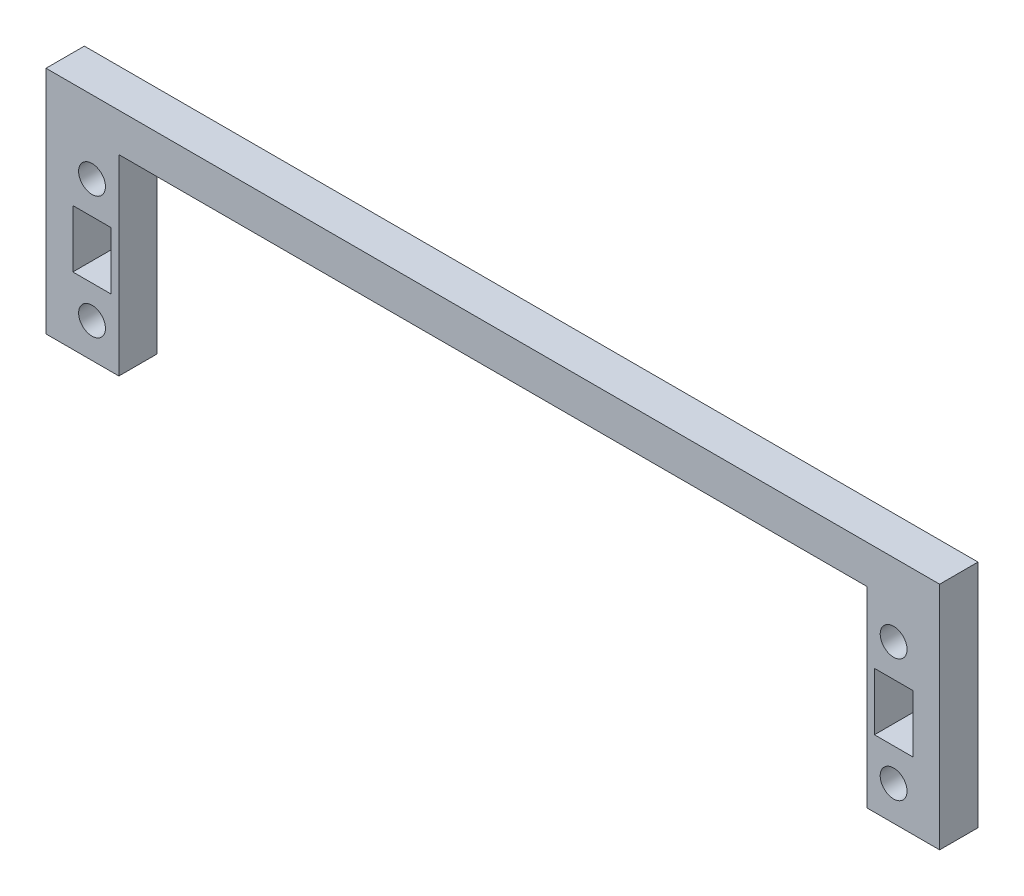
ISO-10303-21;
HEADER;
FILE_DESCRIPTION(('STEP AP214'),'2;1');
FILE_NAME('part.step','',(''),(''),'','','');
FILE_SCHEMA(('AUTOMOTIVE_DESIGN { 1 0 10303 214 1 1 1 1 }'));
ENDSEC;
DATA;
#1=APPLICATION_CONTEXT('core data for automotive mechanical design processes');
#2=APPLICATION_PROTOCOL_DEFINITION('international standard','automotive_design',2000,#1);
#3=PRODUCT_CONTEXT('',#1,'mechanical');
#4=PRODUCT('Part','Part','',(#3));
#5=PRODUCT_RELATED_PRODUCT_CATEGORY('part','',(#4));
#6=PRODUCT_DEFINITION_FORMATION('','',#4);
#7=PRODUCT_DEFINITION_CONTEXT('part definition',#1,'design');
#8=PRODUCT_DEFINITION('design','',#6,#7);
#9=PRODUCT_DEFINITION_SHAPE('','',#8);
#10=(LENGTH_UNIT() NAMED_UNIT(*) SI_UNIT(.MILLI.,.METRE.));
#11=(NAMED_UNIT(*) PLANE_ANGLE_UNIT() SI_UNIT($,.RADIAN.));
#12=(NAMED_UNIT(*) SI_UNIT($,.STERADIAN.) SOLID_ANGLE_UNIT());
#13=UNCERTAINTY_MEASURE_WITH_UNIT(LENGTH_MEASURE(1.E-05),#10,'distance_accuracy_value','');
#14=(GEOMETRIC_REPRESENTATION_CONTEXT(3) GLOBAL_UNCERTAINTY_ASSIGNED_CONTEXT((#13)) GLOBAL_UNIT_ASSIGNED_CONTEXT((#10,
#11,#12)) REPRESENTATION_CONTEXT('',''));
#15=CARTESIAN_POINT('',(0.,0.,0.));
#16=DIRECTION('',(0.,0.,1.));
#17=DIRECTION('',(1.,0.,0.));
#18=AXIS2_PLACEMENT_3D('',#15,#16,#17);
#19=CARTESIAN_POINT('',(0.,-25.,10.));
#20=DIRECTION('',(0.,-1.,0.));
#21=DIRECTION('',(0.,0.,-1.));
#22=AXIS2_PLACEMENT_3D('',#19,#20,#21);
#23=PLANE('',#22);
#24=DIRECTION('',(-1.,0.,0.));
#25=VECTOR('',#24,1.);
#26=CARTESIAN_POINT('',(0.,-25.,0.));
#27=LINE('',#26,#25);
#28=CARTESIAN_POINT('',(-97.5,-25.,0.));
#29=VERTEX_POINT('',#28);
#30=CARTESIAN_POINT('',(-116.5,-25.,0.));
#31=VERTEX_POINT('',#30);
#32=EDGE_CURVE('E102',#29,#31,#27,.T.);
#33=ORIENTED_EDGE('',*,*,#32,.F.);
#34=DIRECTION('',(0.,0.,-1.));
#35=VECTOR('',#34,1.);
#36=CARTESIAN_POINT('',(-97.5,-25.,10.));
#37=LINE('',#36,#35);
#38=CARTESIAN_POINT('',(-97.5,-25.,10.));
#39=VERTEX_POINT('',#38);
#40=EDGE_CURVE('E11',#39,#29,#37,.T.);
#41=ORIENTED_EDGE('',*,*,#40,.F.);
#42=DIRECTION('',(-1.,0.,0.));
#43=VECTOR('',#42,1.);
#44=CARTESIAN_POINT('',(0.,-25.,10.));
#45=LINE('',#44,#43);
#46=CARTESIAN_POINT('',(-116.5,-25.,10.));
#47=VERTEX_POINT('',#46);
#48=EDGE_CURVE('E100',#39,#47,#45,.T.);
#49=ORIENTED_EDGE('',*,*,#48,.T.);
#50=DIRECTION('',(0.,0.,-1.));
#51=VECTOR('',#50,1.);
#52=CARTESIAN_POINT('',(-116.5,-25.,10.));
#53=LINE('',#52,#51);
#54=EDGE_CURVE('E52',#47,#31,#53,.T.);
#55=ORIENTED_EDGE('',*,*,#54,.T.);
#56=EDGE_LOOP('',(#33,#41,#49,#55));
#57=FACE_BOUND('',#56,.T.);
#58=ADVANCED_FACE('F33',(#57),#23,.T.);
#59=CARTESIAN_POINT('',(-97.5,0.,10.));
#60=DIRECTION('',(-1.,0.,0.));
#61=DIRECTION('',(0.,0.,1.));
#62=AXIS2_PLACEMENT_3D('',#59,#60,#61);
#63=PLANE('',#62);
#64=DIRECTION('',(0.,1.,0.));
#65=VECTOR('',#64,1.);
#66=CARTESIAN_POINT('',(-97.5,0.,0.));
#67=LINE('',#66,#65);
#68=CARTESIAN_POINT('',(-97.5,25.,0.));
#69=VERTEX_POINT('',#68);
#70=EDGE_CURVE('E144',#29,#69,#67,.T.);
#71=ORIENTED_EDGE('',*,*,#70,.T.);
#72=DIRECTION('',(0.,0.,-1.));
#73=VECTOR('',#72,1.);
#74=CARTESIAN_POINT('',(-97.5,25.,10.));
#75=LINE('',#74,#73);
#76=CARTESIAN_POINT('',(-97.5,25.,10.));
#77=VERTEX_POINT('',#76);
#78=EDGE_CURVE('E43',#77,#69,#75,.T.);
#79=ORIENTED_EDGE('',*,*,#78,.F.);
#80=DIRECTION('',(0.,1.,0.));
#81=VECTOR('',#80,1.);
#82=CARTESIAN_POINT('',(-97.5,0.,10.));
#83=LINE('',#82,#81);
#84=EDGE_CURVE('E104',#39,#77,#83,.T.);
#85=ORIENTED_EDGE('',*,*,#84,.F.);
#86=ORIENTED_EDGE('',*,*,#40,.T.);
#87=EDGE_LOOP('',(#71,#79,#85,#86));
#88=FACE_BOUND('',#87,.T.);
#89=ADVANCED_FACE('F105',(#88),#63,.F.);
#90=CARTESIAN_POINT('',(0.,7.49999999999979,10.));
#91=DIRECTION('',(0.,1.,0.));
#92=DIRECTION('',(-1.,0.,0.));
#93=AXIS2_PLACEMENT_3D('',#90,#91,#92);
#94=PLANE('',#93);
#95=DIRECTION('',(1.,0.,0.));
#96=VECTOR('',#95,1.);
#97=CARTESIAN_POINT('',(0.,7.49999999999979,0.));
#98=LINE('',#97,#96);
#99=CARTESIAN_POINT('',(-109.5,7.5,0.));
#100=VERTEX_POINT('',#99);
#101=CARTESIAN_POINT('',(-99.5,7.49999999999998,0.));
#102=VERTEX_POINT('',#101);
#103=EDGE_CURVE('E130',#100,#102,#98,.T.);
#104=ORIENTED_EDGE('',*,*,#103,.T.);
#105=DIRECTION('',(0.,0.,-1.));
#106=VECTOR('',#105,1.);
#107=CARTESIAN_POINT('',(-99.5,7.49999999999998,10.));
#108=LINE('',#107,#106);
#109=CARTESIAN_POINT('',(-99.5,7.49999999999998,10.));
#110=VERTEX_POINT('',#109);
#111=EDGE_CURVE('E37',#110,#102,#108,.T.);
#112=ORIENTED_EDGE('',*,*,#111,.F.);
#113=DIRECTION('',(1.,0.,0.));
#114=VECTOR('',#113,1.);
#115=CARTESIAN_POINT('',(0.,7.49999999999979,10.));
#116=LINE('',#115,#114);
#117=CARTESIAN_POINT('',(-109.5,7.5,10.));
#118=VERTEX_POINT('',#117);
#119=EDGE_CURVE('E155',#118,#110,#116,.T.);
#120=ORIENTED_EDGE('',*,*,#119,.F.);
#121=DIRECTION('',(0.,0.,-1.));
#122=VECTOR('',#121,1.);
#123=CARTESIAN_POINT('',(-109.5,7.5,10.));
#124=LINE('',#123,#122);
#125=EDGE_CURVE('E129',#118,#100,#124,.T.);
#126=ORIENTED_EDGE('',*,*,#125,.T.);
#127=EDGE_LOOP('',(#104,#112,#120,#126));
#128=FACE_BOUND('',#127,.T.);
#129=ADVANCED_FACE('F35',(#128),#94,.F.);
#130=CARTESIAN_POINT('',(-99.5,0.,10.));
#131=DIRECTION('',(1.,0.,0.));
#132=DIRECTION('',(0.,0.,-1.));
#133=AXIS2_PLACEMENT_3D('',#130,#131,#132);
#134=PLANE('',#133);
#135=DIRECTION('',(0.,-1.,0.));
#136=VECTOR('',#135,1.);
#137=CARTESIAN_POINT('',(-99.5,0.,0.));
#138=LINE('',#137,#136);
#139=CARTESIAN_POINT('',(-99.5,-7.50000000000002,0.));
#140=VERTEX_POINT('',#139);
#141=EDGE_CURVE('E133',#102,#140,#138,.T.);
#142=ORIENTED_EDGE('',*,*,#141,.T.);
#143=DIRECTION('',(0.,0.,-1.));
#144=VECTOR('',#143,1.);
#145=CARTESIAN_POINT('',(-99.5,-7.50000000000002,10.));
#146=LINE('',#145,#144);
#147=CARTESIAN_POINT('',(-99.5,-7.50000000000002,10.));
#148=VERTEX_POINT('',#147);
#149=EDGE_CURVE('E160',#148,#140,#146,.T.);
#150=ORIENTED_EDGE('',*,*,#149,.F.);
#151=DIRECTION('',(0.,-1.,0.));
#152=VECTOR('',#151,1.);
#153=CARTESIAN_POINT('',(-99.5,0.,10.));
#154=LINE('',#153,#152);
#155=EDGE_CURVE('E88',#110,#148,#154,.T.);
#156=ORIENTED_EDGE('',*,*,#155,.F.);
#157=ORIENTED_EDGE('',*,*,#111,.T.);
#158=EDGE_LOOP('',(#142,#150,#156,#157));
#159=FACE_BOUND('',#158,.T.);
#160=ADVANCED_FACE('F165',(#159),#134,.F.);
#161=CARTESIAN_POINT('',(0.,-7.50000000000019,10.));
#162=DIRECTION('',(0.,1.,0.));
#163=DIRECTION('',(-1.,0.,0.));
#164=AXIS2_PLACEMENT_3D('',#161,#162,#163);
#165=PLANE('',#164);
#166=DIRECTION('',(1.,0.,0.));
#167=VECTOR('',#166,1.);
#168=CARTESIAN_POINT('',(0.,-7.50000000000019,0.));
#169=LINE('',#168,#167);
#170=CARTESIAN_POINT('',(-109.5,-7.5,0.));
#171=VERTEX_POINT('',#170);
#172=EDGE_CURVE('E137',#171,#140,#169,.T.);
#173=ORIENTED_EDGE('',*,*,#172,.F.);
#174=DIRECTION('',(0.,0.,-1.));
#175=VECTOR('',#174,1.);
#176=CARTESIAN_POINT('',(-109.5,-7.5,10.));
#177=LINE('',#176,#175);
#178=CARTESIAN_POINT('',(-109.5,-7.5,10.));
#179=VERTEX_POINT('',#178);
#180=EDGE_CURVE('E159',#179,#171,#177,.T.);
#181=ORIENTED_EDGE('',*,*,#180,.F.);
#182=DIRECTION('',(1.,0.,0.));
#183=VECTOR('',#182,1.);
#184=CARTESIAN_POINT('',(0.,-7.50000000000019,10.));
#185=LINE('',#184,#183);
#186=EDGE_CURVE('E118',#179,#148,#185,.T.);
#187=ORIENTED_EDGE('',*,*,#186,.T.);
#188=ORIENTED_EDGE('',*,*,#149,.T.);
#189=EDGE_LOOP('',(#173,#181,#187,#188));
#190=FACE_BOUND('',#189,.T.);
#191=ADVANCED_FACE('F177',(#190),#165,.T.);
#192=CARTESIAN_POINT('',(-104.5,16.,10.));
#193=DIRECTION('',(0.,0.,-1.));
#194=DIRECTION('',(-1.,0.,0.));
#195=AXIS2_PLACEMENT_3D('',#192,#193,#194);
#196=CYLINDRICAL_SURFACE('',#195,3.50000000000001);
#197=CARTESIAN_POINT('',(-104.5,16.,10.));
#198=DIRECTION('',(0.,0.,1.));
#199=DIRECTION('',(1.,0.,0.));
#200=AXIS2_PLACEMENT_3D('',#197,#198,#199);
#201=CIRCLE('',#200,3.50000000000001);
#202=CARTESIAN_POINT('',(-101.,16.,10.));
#203=VERTEX_POINT('',#202);
#204=EDGE_CURVE('E123',#203,#203,#201,.T.);
#205=ORIENTED_EDGE('',*,*,#204,.T.);
#206=EDGE_LOOP('',(#205));
#207=FACE_BOUND('',#206,.T.);
#208=CARTESIAN_POINT('',(-104.5,16.,0.));
#209=DIRECTION('',(0.,0.,1.));
#210=DIRECTION('',(1.,0.,0.));
#211=AXIS2_PLACEMENT_3D('',#208,#209,#210);
#212=CIRCLE('',#211,3.50000000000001);
#213=CARTESIAN_POINT('',(-101.,16.,0.));
#214=VERTEX_POINT('',#213);
#215=EDGE_CURVE('E149',#214,#214,#212,.T.);
#216=ORIENTED_EDGE('',*,*,#215,.F.);
#217=EDGE_LOOP('',(#216));
#218=FACE_BOUND('',#217,.T.);
#219=ADVANCED_FACE('F179',(#207,#218),#196,.F.);
#220=CARTESIAN_POINT('',(-116.5,0.,10.));
#221=DIRECTION('',(-1.,0.,0.));
#222=DIRECTION('',(0.,0.,1.));
#223=AXIS2_PLACEMENT_3D('',#220,#221,#222);
#224=PLANE('',#223);
#225=DIRECTION('',(0.,1.,0.));
#226=VECTOR('',#225,1.);
#227=CARTESIAN_POINT('',(-116.5,0.,0.));
#228=LINE('',#227,#226);
#229=CARTESIAN_POINT('',(-116.5,35.,0.));
#230=VERTEX_POINT('',#229);
#231=EDGE_CURVE('E146',#31,#230,#228,.T.);
#232=ORIENTED_EDGE('',*,*,#231,.F.);
#233=ORIENTED_EDGE('',*,*,#54,.F.);
#234=DIRECTION('',(0.,1.,0.));
#235=VECTOR('',#234,1.);
#236=CARTESIAN_POINT('',(-116.5,0.,10.));
#237=LINE('',#236,#235);
#238=CARTESIAN_POINT('',(-116.5,35.,10.));
#239=VERTEX_POINT('',#238);
#240=EDGE_CURVE('E110',#47,#239,#237,.T.);
#241=ORIENTED_EDGE('',*,*,#240,.T.);
#242=DIRECTION('',(0.,0.,1.));
#243=VECTOR('',#242,1.);
#244=CARTESIAN_POINT('',(-116.5,35.,0.));
#245=LINE('',#244,#243);
#246=EDGE_CURVE('E308',#230,#239,#245,.T.);
#247=ORIENTED_EDGE('',*,*,#246,.F.);
#248=EDGE_LOOP('',(#232,#233,#241,#247));
#249=FACE_BOUND('',#248,.T.);
#250=ADVANCED_FACE('F185',(#249),#224,.T.);
#251=CARTESIAN_POINT('',(-109.5,0.,10.));
#252=DIRECTION('',(1.,0.,0.));
#253=DIRECTION('',(0.,0.,-1.));
#254=AXIS2_PLACEMENT_3D('',#251,#252,#253);
#255=PLANE('',#254);
#256=DIRECTION('',(0.,-1.,0.));
#257=VECTOR('',#256,1.);
#258=CARTESIAN_POINT('',(-109.5,0.,0.));
#259=LINE('',#258,#257);
#260=EDGE_CURVE('E140',#100,#171,#259,.T.);
#261=ORIENTED_EDGE('',*,*,#260,.F.);
#262=ORIENTED_EDGE('',*,*,#125,.F.);
#263=DIRECTION('',(0.,-1.,0.));
#264=VECTOR('',#263,1.);
#265=CARTESIAN_POINT('',(-109.5,0.,10.));
#266=LINE('',#265,#264);
#267=EDGE_CURVE('E115',#118,#179,#266,.T.);
#268=ORIENTED_EDGE('',*,*,#267,.T.);
#269=ORIENTED_EDGE('',*,*,#180,.T.);
#270=EDGE_LOOP('',(#261,#262,#268,#269));
#271=FACE_BOUND('',#270,.T.);
#272=ADVANCED_FACE('F174',(#271),#255,.T.);
#273=CARTESIAN_POINT('',(-104.5,-16.,10.));
#274=DIRECTION('',(0.,0.,-1.));
#275=DIRECTION('',(-1.,0.,0.));
#276=AXIS2_PLACEMENT_3D('',#273,#274,#275);
#277=CYLINDRICAL_SURFACE('',#276,3.50000000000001);
#278=CARTESIAN_POINT('',(-104.5,-16.,10.));
#279=DIRECTION('',(0.,0.,1.));
#280=DIRECTION('',(1.,0.,0.));
#281=AXIS2_PLACEMENT_3D('',#278,#279,#280);
#282=CIRCLE('',#281,3.50000000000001);
#283=CARTESIAN_POINT('',(-101.,-16.,10.));
#284=VERTEX_POINT('',#283);
#285=EDGE_CURVE('E126',#284,#284,#282,.F.);
#286=ORIENTED_EDGE('',*,*,#285,.F.);
#287=EDGE_LOOP('',(#286));
#288=FACE_BOUND('',#287,.T.);
#289=CARTESIAN_POINT('',(-104.5,-16.,0.));
#290=DIRECTION('',(0.,0.,1.));
#291=DIRECTION('',(1.,0.,0.));
#292=AXIS2_PLACEMENT_3D('',#289,#290,#291);
#293=CIRCLE('',#292,3.50000000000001);
#294=CARTESIAN_POINT('',(-101.,-16.,0.));
#295=VERTEX_POINT('',#294);
#296=EDGE_CURVE('E152',#295,#295,#293,.F.);
#297=ORIENTED_EDGE('',*,*,#296,.T.);
#298=EDGE_LOOP('',(#297));
#299=FACE_BOUND('',#298,.T.);
#300=ADVANCED_FACE('F197',(#288,#299),#277,.F.);
#301=CARTESIAN_POINT('',(0.,0.,10.));
#302=DIRECTION('',(0.,0.,1.));
#303=DIRECTION('',(1.,0.,0.));
#304=AXIS2_PLACEMENT_3D('',#301,#302,#303);
#305=PLANE('',#304);
#306=ORIENTED_EDGE('',*,*,#119,.T.);
#307=ORIENTED_EDGE('',*,*,#155,.T.);
#308=ORIENTED_EDGE('',*,*,#186,.F.);
#309=ORIENTED_EDGE('',*,*,#267,.F.);
#310=EDGE_LOOP('',(#306,#307,#308,#309));
#311=FACE_BOUND('',#310,.T.);
#312=ORIENTED_EDGE('',*,*,#48,.F.);
#313=ORIENTED_EDGE('',*,*,#84,.T.);
#314=DIRECTION('',(1.,0.,0.));
#315=VECTOR('',#314,1.);
#316=CARTESIAN_POINT('',(0.,25.,10.));
#317=LINE('',#316,#315);
#318=CARTESIAN_POINT('',(97.5,25.0000000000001,10.));
#319=VERTEX_POINT('',#318);
#320=EDGE_CURVE('E286',#77,#319,#317,.T.);
#321=ORIENTED_EDGE('',*,*,#320,.T.);
#322=DIRECTION('',(0.,1.,0.));
#323=VECTOR('',#322,1.);
#324=CARTESIAN_POINT('',(97.5,0.,10.));
#325=LINE('',#324,#323);
#326=CARTESIAN_POINT('',(97.5,-24.9999999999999,10.));
#327=VERTEX_POINT('',#326);
#328=EDGE_CURVE('E336',#327,#319,#325,.T.);
#329=ORIENTED_EDGE('',*,*,#328,.F.);
#330=DIRECTION('',(1.,0.,0.));
#331=VECTOR('',#330,1.);
#332=CARTESIAN_POINT('',(0.,-25.,10.));
#333=LINE('',#332,#331);
#334=CARTESIAN_POINT('',(116.5,-24.9999999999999,10.));
#335=VERTEX_POINT('',#334);
#336=EDGE_CURVE('E334',#327,#335,#333,.T.);
#337=ORIENTED_EDGE('',*,*,#336,.T.);
#338=DIRECTION('',(0.,-1.,0.));
#339=VECTOR('',#338,1.);
#340=CARTESIAN_POINT('',(116.5,35.,10.));
#341=LINE('',#340,#339);
#342=CARTESIAN_POINT('',(116.5,35.,10.));
#343=VERTEX_POINT('',#342);
#344=EDGE_CURVE('E134',#343,#335,#341,.T.);
#345=ORIENTED_EDGE('',*,*,#344,.F.);
#346=DIRECTION('',(1.,0.,0.));
#347=VECTOR('',#346,1.);
#348=CARTESIAN_POINT('',(0.,35.,10.));
#349=LINE('',#348,#347);
#350=EDGE_CURVE('E298',#239,#343,#349,.T.);
#351=ORIENTED_EDGE('',*,*,#350,.F.);
#352=ORIENTED_EDGE('',*,*,#240,.F.);
#353=EDGE_LOOP('',(#312,#313,#321,#329,#337,#345,#351,#352));
#354=FACE_BOUND('',#353,.T.);
#355=ORIENTED_EDGE('',*,*,#204,.F.);
#356=EDGE_LOOP('',(#355));
#357=FACE_BOUND('',#356,.T.);
#358=ORIENTED_EDGE('',*,*,#285,.T.);
#359=EDGE_LOOP('',(#358));
#360=FACE_BOUND('',#359,.T.);
#361=DIRECTION('',(-1.,0.,0.));
#362=VECTOR('',#361,1.);
#363=CARTESIAN_POINT('',(0.,7.49999999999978,10.));
#364=LINE('',#363,#362);
#365=CARTESIAN_POINT('',(109.5,7.50000000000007,10.));
#366=VERTEX_POINT('',#365);
#367=CARTESIAN_POINT('',(99.5,7.50000000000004,10.));
#368=VERTEX_POINT('',#367);
#369=EDGE_CURVE('E265',#366,#368,#364,.T.);
#370=ORIENTED_EDGE('',*,*,#369,.F.);
#371=DIRECTION('',(0.,-1.,0.));
#372=VECTOR('',#371,1.);
#373=CARTESIAN_POINT('',(109.5,2.02615701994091E-13,10.));
#374=LINE('',#373,#372);
#375=CARTESIAN_POINT('',(109.5,-7.49999999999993,10.));
#376=VERTEX_POINT('',#375);
#377=EDGE_CURVE('E269',#366,#376,#374,.T.);
#378=ORIENTED_EDGE('',*,*,#377,.T.);
#379=DIRECTION('',(-1.,0.,0.));
#380=VECTOR('',#379,1.);
#381=CARTESIAN_POINT('',(0.,-7.50000000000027,10.));
#382=LINE('',#381,#380);
#383=CARTESIAN_POINT('',(99.5,-7.49999999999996,10.));
#384=VERTEX_POINT('',#383);
#385=EDGE_CURVE('E368',#376,#384,#382,.T.);
#386=ORIENTED_EDGE('',*,*,#385,.T.);
#387=DIRECTION('',(0.,-1.,0.));
#388=VECTOR('',#387,1.);
#389=CARTESIAN_POINT('',(99.5,1.84111984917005E-13,10.));
#390=LINE('',#389,#388);
#391=EDGE_CURVE('E365',#368,#384,#390,.T.);
#392=ORIENTED_EDGE('',*,*,#391,.F.);
#393=EDGE_LOOP('',(#370,#378,#386,#392));
#394=FACE_BOUND('',#393,.T.);
#395=CARTESIAN_POINT('',(104.5,-15.9999999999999,10.));
#396=DIRECTION('',(0.,0.,1.));
#397=DIRECTION('',(1.,0.,0.));
#398=AXIS2_PLACEMENT_3D('',#395,#396,#397);
#399=CIRCLE('',#398,3.50000000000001);
#400=CARTESIAN_POINT('',(108.,-15.9999999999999,10.));
#401=VERTEX_POINT('',#400);
#402=EDGE_CURVE('E337',#401,#401,#399,.T.);
#403=ORIENTED_EDGE('',*,*,#402,.F.);
#404=EDGE_LOOP('',(#403));
#405=FACE_BOUND('',#404,.T.);
#406=CARTESIAN_POINT('',(104.5,16.0000000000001,10.));
#407=DIRECTION('',(0.,0.,1.));
#408=DIRECTION('',(1.,0.,0.));
#409=AXIS2_PLACEMENT_3D('',#406,#407,#408);
#410=CIRCLE('',#409,3.50000000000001);
#411=CARTESIAN_POINT('',(108.,16.0000000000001,10.));
#412=VERTEX_POINT('',#411);
#413=EDGE_CURVE('E260',#412,#412,#410,.F.);
#414=ORIENTED_EDGE('',*,*,#413,.T.);
#415=EDGE_LOOP('',(#414));
#416=FACE_BOUND('',#415,.T.);
#417=ADVANCED_FACE('F112',(#311,#354,#357,#360,#394,#405,#416),#305,.T.);
#418=CARTESIAN_POINT('',(0.,0.,0.));
#419=DIRECTION('',(0.,0.,1.));
#420=DIRECTION('',(1.,0.,0.));
#421=AXIS2_PLACEMENT_3D('',#418,#419,#420);
#422=PLANE('',#421);
#423=ORIENTED_EDGE('',*,*,#103,.F.);
#424=ORIENTED_EDGE('',*,*,#260,.T.);
#425=ORIENTED_EDGE('',*,*,#172,.T.);
#426=ORIENTED_EDGE('',*,*,#141,.F.);
#427=EDGE_LOOP('',(#423,#424,#425,#426));
#428=FACE_BOUND('',#427,.T.);
#429=ORIENTED_EDGE('',*,*,#32,.T.);
#430=ORIENTED_EDGE('',*,*,#231,.T.);
#431=DIRECTION('',(1.,0.,0.));
#432=VECTOR('',#431,1.);
#433=CARTESIAN_POINT('',(0.,35.,0.));
#434=LINE('',#433,#432);
#435=CARTESIAN_POINT('',(116.5,35.,0.));
#436=VERTEX_POINT('',#435);
#437=EDGE_CURVE('E305',#230,#436,#434,.T.);
#438=ORIENTED_EDGE('',*,*,#437,.T.);
#439=DIRECTION('',(0.,-1.,0.));
#440=VECTOR('',#439,1.);
#441=CARTESIAN_POINT('',(116.5,35.,0.));
#442=LINE('',#441,#440);
#443=CARTESIAN_POINT('',(116.5,-24.9999999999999,0.));
#444=VERTEX_POINT('',#443);
#445=EDGE_CURVE('E311',#436,#444,#442,.T.);
#446=ORIENTED_EDGE('',*,*,#445,.T.);
#447=DIRECTION('',(1.,0.,0.));
#448=VECTOR('',#447,1.);
#449=CARTESIAN_POINT('',(0.,-25.,0.));
#450=LINE('',#449,#448);
#451=CARTESIAN_POINT('',(97.5,-24.9999999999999,0.));
#452=VERTEX_POINT('',#451);
#453=EDGE_CURVE('E272',#452,#444,#450,.T.);
#454=ORIENTED_EDGE('',*,*,#453,.F.);
#455=DIRECTION('',(0.,1.,0.));
#456=VECTOR('',#455,1.);
#457=CARTESIAN_POINT('',(97.5,0.,0.));
#458=LINE('',#457,#456);
#459=CARTESIAN_POINT('',(97.5,25.0000000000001,0.));
#460=VERTEX_POINT('',#459);
#461=EDGE_CURVE('E346',#452,#460,#458,.T.);
#462=ORIENTED_EDGE('',*,*,#461,.T.);
#463=DIRECTION('',(1.,0.,0.));
#464=VECTOR('',#463,1.);
#465=CARTESIAN_POINT('',(0.,25.,0.));
#466=LINE('',#465,#464);
#467=EDGE_CURVE('E302',#69,#460,#466,.T.);
#468=ORIENTED_EDGE('',*,*,#467,.F.);
#469=ORIENTED_EDGE('',*,*,#70,.F.);
#470=EDGE_LOOP('',(#429,#430,#438,#446,#454,#462,#468,#469));
#471=FACE_BOUND('',#470,.T.);
#472=ORIENTED_EDGE('',*,*,#215,.T.);
#473=EDGE_LOOP('',(#472));
#474=FACE_BOUND('',#473,.T.);
#475=ORIENTED_EDGE('',*,*,#296,.F.);
#476=EDGE_LOOP('',(#475));
#477=FACE_BOUND('',#476,.T.);
#478=DIRECTION('',(-1.,0.,0.));
#479=VECTOR('',#478,1.);
#480=CARTESIAN_POINT('',(0.,7.49999999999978,0.));
#481=LINE('',#480,#479);
#482=CARTESIAN_POINT('',(109.5,7.50000000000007,0.));
#483=VERTEX_POINT('',#482);
#484=CARTESIAN_POINT('',(99.5,7.50000000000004,0.));
#485=VERTEX_POINT('',#484);
#486=EDGE_CURVE('E358',#483,#485,#481,.T.);
#487=ORIENTED_EDGE('',*,*,#486,.T.);
#488=DIRECTION('',(0.,-1.,0.));
#489=VECTOR('',#488,1.);
#490=CARTESIAN_POINT('',(99.5,1.84111984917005E-13,0.));
#491=LINE('',#490,#489);
#492=CARTESIAN_POINT('',(99.5,-7.49999999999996,0.));
#493=VERTEX_POINT('',#492);
#494=EDGE_CURVE('E347',#485,#493,#491,.T.);
#495=ORIENTED_EDGE('',*,*,#494,.T.);
#496=DIRECTION('',(-1.,0.,0.));
#497=VECTOR('',#496,1.);
#498=CARTESIAN_POINT('',(0.,-7.50000000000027,0.));
#499=LINE('',#498,#497);
#500=CARTESIAN_POINT('',(109.5,-7.49999999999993,0.));
#501=VERTEX_POINT('',#500);
#502=EDGE_CURVE('E352',#501,#493,#499,.T.);
#503=ORIENTED_EDGE('',*,*,#502,.F.);
#504=DIRECTION('',(0.,-1.,0.));
#505=VECTOR('',#504,1.);
#506=CARTESIAN_POINT('',(109.5,2.02615701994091E-13,0.));
#507=LINE('',#506,#505);
#508=EDGE_CURVE('E355',#483,#501,#507,.T.);
#509=ORIENTED_EDGE('',*,*,#508,.F.);
#510=EDGE_LOOP('',(#487,#495,#503,#509));
#511=FACE_BOUND('',#510,.T.);
#512=CARTESIAN_POINT('',(104.5,-15.9999999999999,0.));
#513=DIRECTION('',(0.,0.,1.));
#514=DIRECTION('',(1.,0.,0.));
#515=AXIS2_PLACEMENT_3D('',#512,#513,#514);
#516=CIRCLE('',#515,3.50000000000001);
#517=CARTESIAN_POINT('',(108.,-15.9999999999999,0.));
#518=VERTEX_POINT('',#517);
#519=EDGE_CURVE('E266',#518,#518,#516,.T.);
#520=ORIENTED_EDGE('',*,*,#519,.T.);
#521=EDGE_LOOP('',(#520));
#522=FACE_BOUND('',#521,.T.);
#523=CARTESIAN_POINT('',(104.5,16.0000000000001,0.));
#524=DIRECTION('',(0.,0.,1.));
#525=DIRECTION('',(1.,0.,0.));
#526=AXIS2_PLACEMENT_3D('',#523,#524,#525);
#527=CIRCLE('',#526,3.50000000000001);
#528=CARTESIAN_POINT('',(108.,16.0000000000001,0.));
#529=VERTEX_POINT('',#528);
#530=EDGE_CURVE('E263',#529,#529,#527,.F.);
#531=ORIENTED_EDGE('',*,*,#530,.F.);
#532=EDGE_LOOP('',(#531));
#533=FACE_BOUND('',#532,.T.);
#534=ADVANCED_FACE('F171',(#428,#471,#474,#477,#511,#522,#533),#422,.F.);
#535=CARTESIAN_POINT('',(0.,25.,0.));
#536=DIRECTION('',(0.,1.,0.));
#537=DIRECTION('',(0.,0.,1.));
#538=AXIS2_PLACEMENT_3D('',#535,#536,#537);
#539=PLANE('',#538);
#540=ORIENTED_EDGE('',*,*,#467,.T.);
#541=DIRECTION('',(0.,0.,-1.));
#542=VECTOR('',#541,1.);
#543=CARTESIAN_POINT('',(97.5,25.0000000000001,10.));
#544=LINE('',#543,#542);
#545=EDGE_CURVE('E276',#319,#460,#544,.T.);
#546=ORIENTED_EDGE('',*,*,#545,.F.);
#547=ORIENTED_EDGE('',*,*,#320,.F.);
#548=ORIENTED_EDGE('',*,*,#78,.T.);
#549=EDGE_LOOP('',(#540,#546,#547,#548));
#550=FACE_BOUND('',#549,.T.);
#551=ADVANCED_FACE('F209',(#550),#539,.F.);
#552=CARTESIAN_POINT('',(116.5,35.,0.));
#553=DIRECTION('',(-1.,0.,0.));
#554=DIRECTION('',(0.,0.,1.));
#555=AXIS2_PLACEMENT_3D('',#552,#553,#554);
#556=PLANE('',#555);
#557=ORIENTED_EDGE('',*,*,#344,.T.);
#558=DIRECTION('',(0.,0.,-1.));
#559=VECTOR('',#558,1.);
#560=CARTESIAN_POINT('',(116.5,-24.9999999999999,10.));
#561=LINE('',#560,#559);
#562=EDGE_CURVE('E279',#335,#444,#561,.T.);
#563=ORIENTED_EDGE('',*,*,#562,.T.);
#564=ORIENTED_EDGE('',*,*,#445,.F.);
#565=DIRECTION('',(0.,0.,-1.));
#566=VECTOR('',#565,1.);
#567=CARTESIAN_POINT('',(116.5,35.,0.));
#568=LINE('',#567,#566);
#569=EDGE_CURVE('E301',#343,#436,#568,.T.);
#570=ORIENTED_EDGE('',*,*,#569,.F.);
#571=EDGE_LOOP('',(#557,#563,#564,#570));
#572=FACE_BOUND('',#571,.T.);
#573=ADVANCED_FACE('F213',(#572),#556,.F.);
#574=CARTESIAN_POINT('',(0.,35.,0.));
#575=DIRECTION('',(0.,1.,0.));
#576=DIRECTION('',(0.,0.,1.));
#577=AXIS2_PLACEMENT_3D('',#574,#575,#576);
#578=PLANE('',#577);
#579=ORIENTED_EDGE('',*,*,#350,.T.);
#580=ORIENTED_EDGE('',*,*,#569,.T.);
#581=ORIENTED_EDGE('',*,*,#437,.F.);
#582=ORIENTED_EDGE('',*,*,#246,.T.);
#583=EDGE_LOOP('',(#579,#580,#581,#582));
#584=FACE_BOUND('',#583,.T.);
#585=ADVANCED_FACE('F216',(#584),#578,.T.);
#586=CARTESIAN_POINT('',(97.5,0.,10.));
#587=DIRECTION('',(-1.,0.,0.));
#588=DIRECTION('',(0.,-1.,0.));
#589=AXIS2_PLACEMENT_3D('',#586,#587,#588);
#590=PLANE('',#589);
#591=ORIENTED_EDGE('',*,*,#461,.F.);
#592=DIRECTION('',(0.,0.,-1.));
#593=VECTOR('',#592,1.);
#594=CARTESIAN_POINT('',(97.5,-24.9999999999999,10.));
#595=LINE('',#594,#593);
#596=EDGE_CURVE('E283',#327,#452,#595,.T.);
#597=ORIENTED_EDGE('',*,*,#596,.F.);
#598=ORIENTED_EDGE('',*,*,#328,.T.);
#599=ORIENTED_EDGE('',*,*,#545,.T.);
#600=EDGE_LOOP('',(#591,#597,#598,#599));
#601=FACE_BOUND('',#600,.T.);
#602=ADVANCED_FACE('F223',(#601),#590,.T.);
#603=CARTESIAN_POINT('',(0.,-25.,10.));
#604=DIRECTION('',(0.,1.,0.));
#605=DIRECTION('',(-1.,0.,0.));
#606=AXIS2_PLACEMENT_3D('',#603,#604,#605);
#607=PLANE('',#606);
#608=ORIENTED_EDGE('',*,*,#453,.T.);
#609=ORIENTED_EDGE('',*,*,#562,.F.);
#610=ORIENTED_EDGE('',*,*,#336,.F.);
#611=ORIENTED_EDGE('',*,*,#596,.T.);
#612=EDGE_LOOP('',(#608,#609,#610,#611));
#613=FACE_BOUND('',#612,.T.);
#614=ADVANCED_FACE('F229',(#613),#607,.F.);
#615=CARTESIAN_POINT('',(0.,7.49999999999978,10.));
#616=DIRECTION('',(0.,-1.,0.));
#617=DIRECTION('',(1.,0.,0.));
#618=AXIS2_PLACEMENT_3D('',#615,#616,#617);
#619=PLANE('',#618);
#620=ORIENTED_EDGE('',*,*,#486,.F.);
#621=DIRECTION('',(0.,0.,-1.));
#622=VECTOR('',#621,1.);
#623=CARTESIAN_POINT('',(109.5,7.50000000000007,10.));
#624=LINE('',#623,#622);
#625=EDGE_CURVE('E280',#366,#483,#624,.T.);
#626=ORIENTED_EDGE('',*,*,#625,.F.);
#627=ORIENTED_EDGE('',*,*,#369,.T.);
#628=DIRECTION('',(0.,0.,-1.));
#629=VECTOR('',#628,1.);
#630=CARTESIAN_POINT('',(99.5,7.50000000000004,10.));
#631=LINE('',#630,#629);
#632=EDGE_CURVE('E287',#368,#485,#631,.T.);
#633=ORIENTED_EDGE('',*,*,#632,.T.);
#634=EDGE_LOOP('',(#620,#626,#627,#633));
#635=FACE_BOUND('',#634,.T.);
#636=ADVANCED_FACE('F225',(#635),#619,.T.);
#637=CARTESIAN_POINT('',(109.5,2.02615701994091E-13,10.));
#638=DIRECTION('',(1.,0.,0.));
#639=DIRECTION('',(0.,1.,0.));
#640=AXIS2_PLACEMENT_3D('',#637,#638,#639);
#641=PLANE('',#640);
#642=ORIENTED_EDGE('',*,*,#508,.T.);
#643=DIRECTION('',(0.,0.,-1.));
#644=VECTOR('',#643,1.);
#645=CARTESIAN_POINT('',(109.5,-7.49999999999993,10.));
#646=LINE('',#645,#644);
#647=EDGE_CURVE('E293',#376,#501,#646,.T.);
#648=ORIENTED_EDGE('',*,*,#647,.F.);
#649=ORIENTED_EDGE('',*,*,#377,.F.);
#650=ORIENTED_EDGE('',*,*,#625,.T.);
#651=EDGE_LOOP('',(#642,#648,#649,#650));
#652=FACE_BOUND('',#651,.T.);
#653=ADVANCED_FACE('F228',(#652),#641,.F.);
#654=CARTESIAN_POINT('',(0.,-7.50000000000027,10.));
#655=DIRECTION('',(0.,-1.,0.));
#656=DIRECTION('',(1.,0.,0.));
#657=AXIS2_PLACEMENT_3D('',#654,#655,#656);
#658=PLANE('',#657);
#659=ORIENTED_EDGE('',*,*,#502,.T.);
#660=DIRECTION('',(0.,0.,-1.));
#661=VECTOR('',#660,1.);
#662=CARTESIAN_POINT('',(99.5,-7.49999999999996,10.));
#663=LINE('',#662,#661);
#664=EDGE_CURVE('E290',#384,#493,#663,.T.);
#665=ORIENTED_EDGE('',*,*,#664,.F.);
#666=ORIENTED_EDGE('',*,*,#385,.F.);
#667=ORIENTED_EDGE('',*,*,#647,.T.);
#668=EDGE_LOOP('',(#659,#665,#666,#667));
#669=FACE_BOUND('',#668,.T.);
#670=ADVANCED_FACE('F233',(#669),#658,.F.);
#671=CARTESIAN_POINT('',(104.5,-15.9999999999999,10.));
#672=DIRECTION('',(0.,0.,-1.));
#673=DIRECTION('',(-1.,0.,0.));
#674=AXIS2_PLACEMENT_3D('',#671,#672,#673);
#675=CYLINDRICAL_SURFACE('',#674,3.50000000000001);
#676=ORIENTED_EDGE('',*,*,#402,.T.);
#677=EDGE_LOOP('',(#676));
#678=FACE_BOUND('',#677,.T.);
#679=ORIENTED_EDGE('',*,*,#519,.F.);
#680=EDGE_LOOP('',(#679));
#681=FACE_BOUND('',#680,.T.);
#682=ADVANCED_FACE('F237',(#678,#681),#675,.F.);
#683=CARTESIAN_POINT('',(99.5,1.84111984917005E-13,10.));
#684=DIRECTION('',(1.,0.,0.));
#685=DIRECTION('',(0.,1.,0.));
#686=AXIS2_PLACEMENT_3D('',#683,#684,#685);
#687=PLANE('',#686);
#688=ORIENTED_EDGE('',*,*,#494,.F.);
#689=ORIENTED_EDGE('',*,*,#632,.F.);
#690=ORIENTED_EDGE('',*,*,#391,.T.);
#691=ORIENTED_EDGE('',*,*,#664,.T.);
#692=EDGE_LOOP('',(#688,#689,#690,#691));
#693=FACE_BOUND('',#692,.T.);
#694=ADVANCED_FACE('F239',(#693),#687,.T.);
#695=CARTESIAN_POINT('',(104.5,16.0000000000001,10.));
#696=DIRECTION('',(0.,0.,-1.));
#697=DIRECTION('',(-1.,0.,0.));
#698=AXIS2_PLACEMENT_3D('',#695,#696,#697);
#699=CYLINDRICAL_SURFACE('',#698,3.50000000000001);
#700=ORIENTED_EDGE('',*,*,#413,.F.);
#701=EDGE_LOOP('',(#700));
#702=FACE_BOUND('',#701,.T.);
#703=ORIENTED_EDGE('',*,*,#530,.T.);
#704=EDGE_LOOP('',(#703));
#705=FACE_BOUND('',#704,.T.);
#706=ADVANCED_FACE('F242',(#702,#705),#699,.F.);
#707=CLOSED_SHELL('',(#58,#89,#129,#160,#191,#219,#250,#272,#300,#417,#534,#551,#573,#585,#602,
#614,#636,#653,#670,#682,#694,#706));
#708=MANIFOLD_SOLID_BREP('B2',#707);
#709=ADVANCED_BREP_SHAPE_REPRESENTATION('',(#18,#708),#14);
#710=SHAPE_DEFINITION_REPRESENTATION(#9,#709);
ENDSEC;
END-ISO-10303-21;
